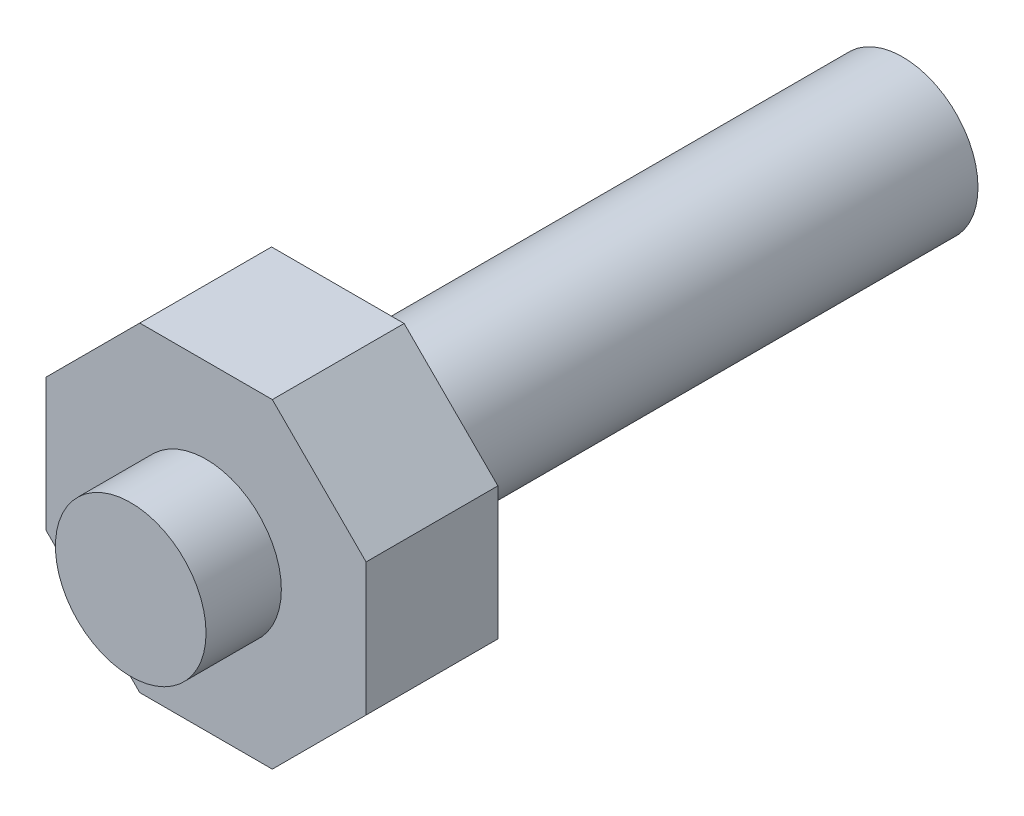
ISO-10303-21;
HEADER;
FILE_DESCRIPTION(('STEP AP214'),'2;1');
FILE_NAME('part.step','',(''),(''),'','','');
FILE_SCHEMA(('AUTOMOTIVE_DESIGN { 1 0 10303 214 1 1 1 1 }'));
ENDSEC;
DATA;
#1=APPLICATION_CONTEXT('core data for automotive mechanical design processes');
#2=APPLICATION_PROTOCOL_DEFINITION('international standard','automotive_design',2000,#1);
#3=PRODUCT_CONTEXT('',#1,'mechanical');
#4=PRODUCT('Part','Part','',(#3));
#5=PRODUCT_RELATED_PRODUCT_CATEGORY('part','',(#4));
#6=PRODUCT_DEFINITION_FORMATION('','',#4);
#7=PRODUCT_DEFINITION_CONTEXT('part definition',#1,'design');
#8=PRODUCT_DEFINITION('design','',#6,#7);
#9=PRODUCT_DEFINITION_SHAPE('','',#8);
#10=(LENGTH_UNIT() NAMED_UNIT(*) SI_UNIT(.MILLI.,.METRE.));
#11=(NAMED_UNIT(*) PLANE_ANGLE_UNIT() SI_UNIT($,.RADIAN.));
#12=(NAMED_UNIT(*) SI_UNIT($,.STERADIAN.) SOLID_ANGLE_UNIT());
#13=UNCERTAINTY_MEASURE_WITH_UNIT(LENGTH_MEASURE(1.E-05),#10,'distance_accuracy_value','');
#14=(GEOMETRIC_REPRESENTATION_CONTEXT(3) GLOBAL_UNCERTAINTY_ASSIGNED_CONTEXT((#13)) GLOBAL_UNIT_ASSIGNED_CONTEXT((#10,
#11,#12)) REPRESENTATION_CONTEXT('',''));
#15=CARTESIAN_POINT('',(0.,0.,0.));
#16=DIRECTION('',(0.,0.,1.));
#17=DIRECTION('',(1.,0.,0.));
#18=AXIS2_PLACEMENT_3D('',#15,#16,#17);
#19=CARTESIAN_POINT('',(4.,0.,30.));
#20=DIRECTION('',(0.,0.,1.));
#21=DIRECTION('',(1.,0.,0.));
#22=AXIS2_PLACEMENT_3D('',#19,#20,#21);
#23=PLANE('',#22);
#24=CARTESIAN_POINT('',(0.,0.,30.));
#25=DIRECTION('',(0.,0.,1.));
#26=DIRECTION('',(1.,0.,0.));
#27=AXIS2_PLACEMENT_3D('',#24,#25,#26);
#28=CIRCLE('',#27,4.);
#29=CARTESIAN_POINT('',(4.,0.,30.));
#30=VERTEX_POINT('',#29);
#31=EDGE_CURVE('E22',#30,#30,#28,.T.);
#32=ORIENTED_EDGE('',*,*,#31,.T.);
#33=EDGE_LOOP('',(#32));
#34=FACE_BOUND('',#33,.T.);
#35=DIRECTION('',(-0.707106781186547,-0.707106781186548,0.));
#36=VECTOR('',#35,1.);
#37=CARTESIAN_POINT('',(8.5,-3.52081528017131,30.));
#38=LINE('',#37,#36);
#39=CARTESIAN_POINT('',(8.5,-3.52081528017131,30.));
#40=VERTEX_POINT('',#39);
#41=CARTESIAN_POINT('',(3.52081528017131,-8.5,30.));
#42=VERTEX_POINT('',#41);
#43=EDGE_CURVE('E101',#40,#42,#38,.T.);
#44=ORIENTED_EDGE('',*,*,#43,.T.);
#45=DIRECTION('',(1.,0.,0.));
#46=VECTOR('',#45,1.);
#47=CARTESIAN_POINT('',(-3.5208152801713,-8.5,30.));
#48=LINE('',#47,#46);
#49=CARTESIAN_POINT('',(-3.5208152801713,-8.5,30.));
#50=VERTEX_POINT('',#49);
#51=EDGE_CURVE('E99',#50,#42,#48,.T.);
#52=ORIENTED_EDGE('',*,*,#51,.F.);
#53=DIRECTION('',(0.707106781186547,-0.707106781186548,0.));
#54=VECTOR('',#53,1.);
#55=CARTESIAN_POINT('',(-8.5,-3.5208152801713,30.));
#56=LINE('',#55,#54);
#57=CARTESIAN_POINT('',(-8.5,-3.5208152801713,30.));
#58=VERTEX_POINT('',#57);
#59=EDGE_CURVE('E29',#58,#50,#56,.T.);
#60=ORIENTED_EDGE('',*,*,#59,.F.);
#61=DIRECTION('',(0.,-1.,0.));
#62=VECTOR('',#61,1.);
#63=CARTESIAN_POINT('',(-8.5,3.52081528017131,30.));
#64=LINE('',#63,#62);
#65=CARTESIAN_POINT('',(-8.5,3.52081528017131,30.));
#66=VERTEX_POINT('',#65);
#67=EDGE_CURVE('E89',#66,#58,#64,.T.);
#68=ORIENTED_EDGE('',*,*,#67,.F.);
#69=DIRECTION('',(0.707106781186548,0.707106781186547,0.));
#70=VECTOR('',#69,1.);
#71=CARTESIAN_POINT('',(-8.5,3.52081528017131,30.));
#72=LINE('',#71,#70);
#73=CARTESIAN_POINT('',(-3.5208152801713,8.5,30.));
#74=VERTEX_POINT('',#73);
#75=EDGE_CURVE('E94',#66,#74,#72,.T.);
#76=ORIENTED_EDGE('',*,*,#75,.T.);
#77=DIRECTION('',(1.,0.,0.));
#78=VECTOR('',#77,1.);
#79=CARTESIAN_POINT('',(-3.5208152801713,8.5,30.));
#80=LINE('',#79,#78);
#81=CARTESIAN_POINT('',(3.5208152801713,8.5,30.));
#82=VERTEX_POINT('',#81);
#83=EDGE_CURVE('E216',#74,#82,#80,.T.);
#84=ORIENTED_EDGE('',*,*,#83,.T.);
#85=DIRECTION('',(0.707106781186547,-0.707106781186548,0.));
#86=VECTOR('',#85,1.);
#87=CARTESIAN_POINT('',(3.5208152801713,8.5,30.));
#88=LINE('',#87,#86);
#89=CARTESIAN_POINT('',(8.5,3.5208152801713,30.));
#90=VERTEX_POINT('',#89);
#91=EDGE_CURVE('E214',#82,#90,#88,.T.);
#92=ORIENTED_EDGE('',*,*,#91,.T.);
#93=DIRECTION('',(0.,-1.,0.));
#94=VECTOR('',#93,1.);
#95=CARTESIAN_POINT('',(8.5,3.5208152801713,30.));
#96=LINE('',#95,#94);
#97=EDGE_CURVE('E126',#90,#40,#96,.T.);
#98=ORIENTED_EDGE('',*,*,#97,.T.);
#99=EDGE_LOOP('',(#44,#52,#60,#68,#76,#84,#92,#98));
#100=FACE_BOUND('',#99,.T.);
#101=ADVANCED_FACE('F14',(#34,#100),#23,.F.);
#102=CARTESIAN_POINT('',(0.,0.,0.));
#103=DIRECTION('',(0.,0.,1.));
#104=DIRECTION('',(1.,0.,0.));
#105=AXIS2_PLACEMENT_3D('',#102,#103,#104);
#106=PLANE('',#105);
#107=CARTESIAN_POINT('',(0.,0.,0.));
#108=DIRECTION('',(0.,0.,1.));
#109=DIRECTION('',(1.,0.,0.));
#110=AXIS2_PLACEMENT_3D('',#107,#108,#109);
#111=CIRCLE('',#110,4.);
#112=CARTESIAN_POINT('',(4.,0.,0.));
#113=VERTEX_POINT('',#112);
#114=EDGE_CURVE('E9',#113,#113,#111,.T.);
#115=ORIENTED_EDGE('',*,*,#114,.F.);
#116=EDGE_LOOP('',(#115));
#117=FACE_BOUND('',#116,.T.);
#118=ADVANCED_FACE('F16',(#117),#106,.F.);
#119=CARTESIAN_POINT('',(0.,0.,80.));
#120=DIRECTION('',(0.,0.,1.));
#121=DIRECTION('',(1.,0.,0.));
#122=AXIS2_PLACEMENT_3D('',#119,#120,#121);
#123=CYLINDRICAL_SURFACE('',#122,4.);
#124=ORIENTED_EDGE('',*,*,#31,.F.);
#125=EDGE_LOOP('',(#124));
#126=FACE_BOUND('',#125,.T.);
#127=ORIENTED_EDGE('',*,*,#114,.T.);
#128=EDGE_LOOP('',(#127));
#129=FACE_BOUND('',#128,.T.);
#130=ADVANCED_FACE('F147',(#126,#129),#123,.T.);
#131=CARTESIAN_POINT('',(8.5,-3.52081528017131,37.));
#132=DIRECTION('',(0.707106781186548,-0.707106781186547,0.));
#133=DIRECTION('',(0.707106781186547,0.707106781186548,0.));
#134=AXIS2_PLACEMENT_3D('',#131,#132,#133);
#135=PLANE('',#134);
#136=DIRECTION('',(0.,0.,-1.));
#137=VECTOR('',#136,1.);
#138=CARTESIAN_POINT('',(8.5,-3.52081528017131,37.));
#139=LINE('',#138,#137);
#140=CARTESIAN_POINT('',(8.5,-3.52081528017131,37.));
#141=VERTEX_POINT('',#140);
#142=EDGE_CURVE('E136',#141,#40,#139,.T.);
#143=ORIENTED_EDGE('',*,*,#142,.F.);
#144=DIRECTION('',(-0.707106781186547,-0.707106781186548,0.));
#145=VECTOR('',#144,1.);
#146=CARTESIAN_POINT('',(8.5,-3.52081528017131,37.));
#147=LINE('',#146,#145);
#148=CARTESIAN_POINT('',(3.52081528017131,-8.5,37.));
#149=VERTEX_POINT('',#148);
#150=EDGE_CURVE('E37',#141,#149,#147,.T.);
#151=ORIENTED_EDGE('',*,*,#150,.T.);
#152=DIRECTION('',(0.,0.,-1.));
#153=VECTOR('',#152,1.);
#154=CARTESIAN_POINT('',(3.52081528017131,-8.5,37.));
#155=LINE('',#154,#153);
#156=EDGE_CURVE('E109',#149,#42,#155,.T.);
#157=ORIENTED_EDGE('',*,*,#156,.T.);
#158=ORIENTED_EDGE('',*,*,#43,.F.);
#159=EDGE_LOOP('',(#143,#151,#157,#158));
#160=FACE_BOUND('',#159,.T.);
#161=ADVANCED_FACE('F150',(#160),#135,.T.);
#162=CARTESIAN_POINT('',(8.5,3.5208152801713,37.));
#163=DIRECTION('',(1.,0.,0.));
#164=DIRECTION('',(0.,1.,0.));
#165=AXIS2_PLACEMENT_3D('',#162,#163,#164);
#166=PLANE('',#165);
#167=DIRECTION('',(0.,0.,-1.));
#168=VECTOR('',#167,1.);
#169=CARTESIAN_POINT('',(8.5,3.5208152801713,37.));
#170=LINE('',#169,#168);
#171=CARTESIAN_POINT('',(8.5,3.5208152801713,37.));
#172=VERTEX_POINT('',#171);
#173=EDGE_CURVE('E134',#172,#90,#170,.T.);
#174=ORIENTED_EDGE('',*,*,#173,.F.);
#175=DIRECTION('',(0.,-1.,0.));
#176=VECTOR('',#175,1.);
#177=CARTESIAN_POINT('',(8.5,3.5208152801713,37.));
#178=LINE('',#177,#176);
#179=EDGE_CURVE('E106',#172,#141,#178,.T.);
#180=ORIENTED_EDGE('',*,*,#179,.T.);
#181=ORIENTED_EDGE('',*,*,#142,.T.);
#182=ORIENTED_EDGE('',*,*,#97,.F.);
#183=EDGE_LOOP('',(#174,#180,#181,#182));
#184=FACE_BOUND('',#183,.T.);
#185=ADVANCED_FACE('F177',(#184),#166,.T.);
#186=CARTESIAN_POINT('',(3.5208152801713,8.5,37.));
#187=DIRECTION('',(0.707106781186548,0.707106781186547,0.));
#188=DIRECTION('',(-0.707106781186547,0.707106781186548,0.));
#189=AXIS2_PLACEMENT_3D('',#186,#187,#188);
#190=PLANE('',#189);
#191=DIRECTION('',(0.,0.,-1.));
#192=VECTOR('',#191,1.);
#193=CARTESIAN_POINT('',(3.5208152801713,8.5,37.));
#194=LINE('',#193,#192);
#195=CARTESIAN_POINT('',(3.5208152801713,8.5,37.));
#196=VERTEX_POINT('',#195);
#197=EDGE_CURVE('E132',#196,#82,#194,.T.);
#198=ORIENTED_EDGE('',*,*,#197,.F.);
#199=DIRECTION('',(0.707106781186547,-0.707106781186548,0.));
#200=VECTOR('',#199,1.);
#201=CARTESIAN_POINT('',(3.5208152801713,8.5,37.));
#202=LINE('',#201,#200);
#203=EDGE_CURVE('E110',#196,#172,#202,.T.);
#204=ORIENTED_EDGE('',*,*,#203,.T.);
#205=ORIENTED_EDGE('',*,*,#173,.T.);
#206=ORIENTED_EDGE('',*,*,#91,.F.);
#207=EDGE_LOOP('',(#198,#204,#205,#206));
#208=FACE_BOUND('',#207,.T.);
#209=ADVANCED_FACE('F180',(#208),#190,.T.);
#210=CARTESIAN_POINT('',(-3.5208152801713,8.5,37.));
#211=DIRECTION('',(0.,1.,0.));
#212=DIRECTION('',(0.,0.,1.));
#213=AXIS2_PLACEMENT_3D('',#210,#211,#212);
#214=PLANE('',#213);
#215=DIRECTION('',(0.,0.,-1.));
#216=VECTOR('',#215,1.);
#217=CARTESIAN_POINT('',(-3.5208152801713,8.5,37.));
#218=LINE('',#217,#216);
#219=CARTESIAN_POINT('',(-3.5208152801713,8.5,37.));
#220=VERTEX_POINT('',#219);
#221=EDGE_CURVE('E130',#220,#74,#218,.T.);
#222=ORIENTED_EDGE('',*,*,#221,.F.);
#223=DIRECTION('',(1.,0.,0.));
#224=VECTOR('',#223,1.);
#225=CARTESIAN_POINT('',(-3.5208152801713,8.5,37.));
#226=LINE('',#225,#224);
#227=EDGE_CURVE('E113',#220,#196,#226,.T.);
#228=ORIENTED_EDGE('',*,*,#227,.T.);
#229=ORIENTED_EDGE('',*,*,#197,.T.);
#230=ORIENTED_EDGE('',*,*,#83,.F.);
#231=EDGE_LOOP('',(#222,#228,#229,#230));
#232=FACE_BOUND('',#231,.T.);
#233=ADVANCED_FACE('F184',(#232),#214,.T.);
#234=CARTESIAN_POINT('',(-8.5,3.52081528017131,37.));
#235=DIRECTION('',(-0.707106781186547,0.707106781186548,0.));
#236=DIRECTION('',(-0.707106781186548,-0.707106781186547,0.));
#237=AXIS2_PLACEMENT_3D('',#234,#235,#236);
#238=PLANE('',#237);
#239=DIRECTION('',(0.,0.,-1.));
#240=VECTOR('',#239,1.);
#241=CARTESIAN_POINT('',(-8.5,3.52081528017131,37.));
#242=LINE('',#241,#240);
#243=CARTESIAN_POINT('',(-8.5,3.52081528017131,37.));
#244=VERTEX_POINT('',#243);
#245=EDGE_CURVE('E85',#244,#66,#242,.T.);
#246=ORIENTED_EDGE('',*,*,#245,.F.);
#247=DIRECTION('',(0.707106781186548,0.707106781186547,0.));
#248=VECTOR('',#247,1.);
#249=CARTESIAN_POINT('',(-8.5,3.52081528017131,37.));
#250=LINE('',#249,#248);
#251=EDGE_CURVE('E116',#244,#220,#250,.T.);
#252=ORIENTED_EDGE('',*,*,#251,.T.);
#253=ORIENTED_EDGE('',*,*,#221,.T.);
#254=ORIENTED_EDGE('',*,*,#75,.F.);
#255=EDGE_LOOP('',(#246,#252,#253,#254));
#256=FACE_BOUND('',#255,.T.);
#257=ADVANCED_FACE('F188',(#256),#238,.T.);
#258=CARTESIAN_POINT('',(-8.5,3.52081528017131,37.));
#259=DIRECTION('',(1.,0.,0.));
#260=DIRECTION('',(0.,1.,0.));
#261=AXIS2_PLACEMENT_3D('',#258,#259,#260);
#262=PLANE('',#261);
#263=DIRECTION('',(0.,0.,-1.));
#264=VECTOR('',#263,1.);
#265=CARTESIAN_POINT('',(-8.5,-3.5208152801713,37.));
#266=LINE('',#265,#264);
#267=CARTESIAN_POINT('',(-8.5,-3.5208152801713,37.));
#268=VERTEX_POINT('',#267);
#269=EDGE_CURVE('E77',#268,#58,#266,.T.);
#270=ORIENTED_EDGE('',*,*,#269,.F.);
#271=DIRECTION('',(0.,-1.,0.));
#272=VECTOR('',#271,1.);
#273=CARTESIAN_POINT('',(-8.5,3.52081528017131,37.));
#274=LINE('',#273,#272);
#275=EDGE_CURVE('E119',#244,#268,#274,.T.);
#276=ORIENTED_EDGE('',*,*,#275,.F.);
#277=ORIENTED_EDGE('',*,*,#245,.T.);
#278=ORIENTED_EDGE('',*,*,#67,.T.);
#279=EDGE_LOOP('',(#270,#276,#277,#278));
#280=FACE_BOUND('',#279,.T.);
#281=ADVANCED_FACE('F90',(#280),#262,.F.);
#282=CARTESIAN_POINT('',(-8.5,-3.5208152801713,37.));
#283=DIRECTION('',(0.707106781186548,0.707106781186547,0.));
#284=DIRECTION('',(-0.707106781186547,0.707106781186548,0.));
#285=AXIS2_PLACEMENT_3D('',#282,#283,#284);
#286=PLANE('',#285);
#287=DIRECTION('',(0.,0.,-1.));
#288=VECTOR('',#287,1.);
#289=CARTESIAN_POINT('',(-3.5208152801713,-8.5,37.));
#290=LINE('',#289,#288);
#291=CARTESIAN_POINT('',(-3.5208152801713,-8.5,37.));
#292=VERTEX_POINT('',#291);
#293=EDGE_CURVE('E86',#292,#50,#290,.T.);
#294=ORIENTED_EDGE('',*,*,#293,.F.);
#295=DIRECTION('',(0.707106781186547,-0.707106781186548,0.));
#296=VECTOR('',#295,1.);
#297=CARTESIAN_POINT('',(-8.5,-3.5208152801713,37.));
#298=LINE('',#297,#296);
#299=EDGE_CURVE('E81',#268,#292,#298,.T.);
#300=ORIENTED_EDGE('',*,*,#299,.F.);
#301=ORIENTED_EDGE('',*,*,#269,.T.);
#302=ORIENTED_EDGE('',*,*,#59,.T.);
#303=EDGE_LOOP('',(#294,#300,#301,#302));
#304=FACE_BOUND('',#303,.T.);
#305=ADVANCED_FACE('F79',(#304),#286,.F.);
#306=CARTESIAN_POINT('',(-3.5208152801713,-8.5,37.));
#307=DIRECTION('',(0.,1.,0.));
#308=DIRECTION('',(0.,0.,1.));
#309=AXIS2_PLACEMENT_3D('',#306,#307,#308);
#310=PLANE('',#309);
#311=DIRECTION('',(1.,0.,0.));
#312=VECTOR('',#311,1.);
#313=CARTESIAN_POINT('',(-3.5208152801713,-8.5,37.));
#314=LINE('',#313,#312);
#315=EDGE_CURVE('E122',#292,#149,#314,.T.);
#316=ORIENTED_EDGE('',*,*,#315,.F.);
#317=ORIENTED_EDGE('',*,*,#293,.T.);
#318=ORIENTED_EDGE('',*,*,#51,.T.);
#319=ORIENTED_EDGE('',*,*,#156,.F.);
#320=EDGE_LOOP('',(#316,#317,#318,#319));
#321=FACE_BOUND('',#320,.T.);
#322=ADVANCED_FACE('F175',(#321),#310,.F.);
#323=CARTESIAN_POINT('',(4.,0.,41.));
#324=DIRECTION('',(0.,0.,-1.));
#325=DIRECTION('',(-1.,0.,0.));
#326=AXIS2_PLACEMENT_3D('',#323,#324,#325);
#327=PLANE('',#326);
#328=CARTESIAN_POINT('',(0.,0.,41.));
#329=DIRECTION('',(0.,0.,1.));
#330=DIRECTION('',(1.,0.,0.));
#331=AXIS2_PLACEMENT_3D('',#328,#329,#330);
#332=CIRCLE('',#331,4.);
#333=CARTESIAN_POINT('',(4.,0.,41.));
#334=VERTEX_POINT('',#333);
#335=EDGE_CURVE('E138',#334,#334,#332,.T.);
#336=ORIENTED_EDGE('',*,*,#335,.T.);
#337=EDGE_LOOP('',(#336));
#338=FACE_BOUND('',#337,.T.);
#339=ADVANCED_FACE('F171',(#338),#327,.F.);
#340=CARTESIAN_POINT('',(0.,0.,80.));
#341=DIRECTION('',(0.,0.,1.));
#342=DIRECTION('',(1.,0.,0.));
#343=AXIS2_PLACEMENT_3D('',#340,#341,#342);
#344=CYLINDRICAL_SURFACE('',#343,4.);
#345=ORIENTED_EDGE('',*,*,#335,.F.);
#346=EDGE_LOOP('',(#345));
#347=FACE_BOUND('',#346,.T.);
#348=CARTESIAN_POINT('',(0.,0.,37.));
#349=DIRECTION('',(0.,0.,1.));
#350=DIRECTION('',(1.,0.,0.));
#351=AXIS2_PLACEMENT_3D('',#348,#349,#350);
#352=CIRCLE('',#351,4.);
#353=CARTESIAN_POINT('',(4.,0.,37.));
#354=VERTEX_POINT('',#353);
#355=EDGE_CURVE('E141',#354,#354,#352,.T.);
#356=ORIENTED_EDGE('',*,*,#355,.T.);
#357=EDGE_LOOP('',(#356));
#358=FACE_BOUND('',#357,.T.);
#359=ADVANCED_FACE('F167',(#347,#358),#344,.T.);
#360=CARTESIAN_POINT('',(10.,0.,37.));
#361=DIRECTION('',(0.,0.,-1.));
#362=DIRECTION('',(-1.,0.,0.));
#363=AXIS2_PLACEMENT_3D('',#360,#361,#362);
#364=PLANE('',#363);
#365=ORIENTED_EDGE('',*,*,#355,.F.);
#366=EDGE_LOOP('',(#365));
#367=FACE_BOUND('',#366,.T.);
#368=ORIENTED_EDGE('',*,*,#150,.F.);
#369=ORIENTED_EDGE('',*,*,#179,.F.);
#370=ORIENTED_EDGE('',*,*,#203,.F.);
#371=ORIENTED_EDGE('',*,*,#227,.F.);
#372=ORIENTED_EDGE('',*,*,#251,.F.);
#373=ORIENTED_EDGE('',*,*,#275,.T.);
#374=ORIENTED_EDGE('',*,*,#299,.T.);
#375=ORIENTED_EDGE('',*,*,#315,.T.);
#376=EDGE_LOOP('',(#368,#369,#370,#371,#372,#373,#374,#375));
#377=FACE_BOUND('',#376,.T.);
#378=ADVANCED_FACE('F164',(#367,#377),#364,.F.);
#379=CLOSED_SHELL('',(#101,#118,#130,#161,#185,#209,#233,#257,#281,#305,#322,#339,#359,#378));
#380=MANIFOLD_SOLID_BREP('B1',#379);
#381=ADVANCED_BREP_SHAPE_REPRESENTATION('',(#18,#380),#14);
#382=SHAPE_DEFINITION_REPRESENTATION(#9,#381);
ENDSEC;
END-ISO-10303-21;
